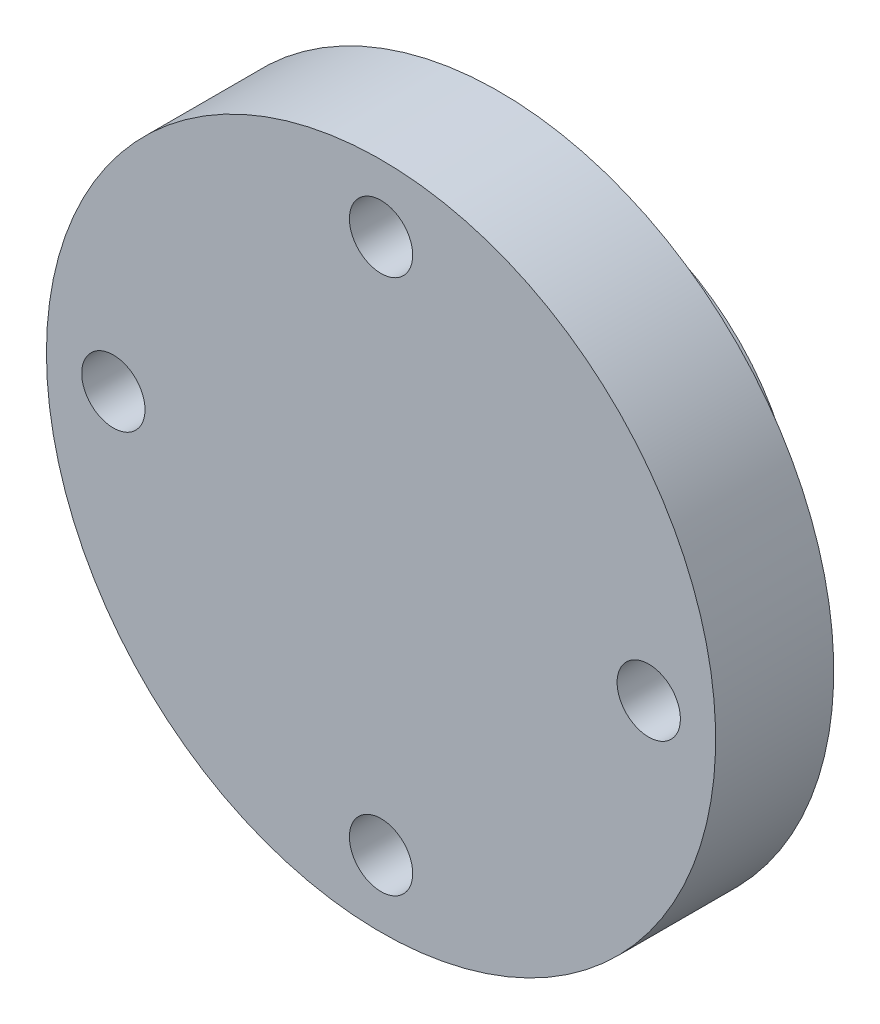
ISO-10303-21;
HEADER;
FILE_DESCRIPTION(('STEP AP214'),'2;1');
FILE_NAME('part.step','',(''),(''),'','','');
FILE_SCHEMA(('AUTOMOTIVE_DESIGN { 1 0 10303 214 1 1 1 1 }'));
ENDSEC;
DATA;
#1=APPLICATION_CONTEXT('core data for automotive mechanical design processes');
#2=APPLICATION_PROTOCOL_DEFINITION('international standard','automotive_design',2000,#1);
#3=PRODUCT_CONTEXT('',#1,'mechanical');
#4=PRODUCT('Part','Part','',(#3));
#5=PRODUCT_RELATED_PRODUCT_CATEGORY('part','',(#4));
#6=PRODUCT_DEFINITION_FORMATION('','',#4);
#7=PRODUCT_DEFINITION_CONTEXT('part definition',#1,'design');
#8=PRODUCT_DEFINITION('design','',#6,#7);
#9=PRODUCT_DEFINITION_SHAPE('','',#8);
#10=(LENGTH_UNIT() NAMED_UNIT(*) SI_UNIT(.MILLI.,.METRE.));
#11=(NAMED_UNIT(*) PLANE_ANGLE_UNIT() SI_UNIT($,.RADIAN.));
#12=(NAMED_UNIT(*) SI_UNIT($,.STERADIAN.) SOLID_ANGLE_UNIT());
#13=UNCERTAINTY_MEASURE_WITH_UNIT(LENGTH_MEASURE(1.E-05),#10,'distance_accuracy_value','');
#14=(GEOMETRIC_REPRESENTATION_CONTEXT(3) GLOBAL_UNCERTAINTY_ASSIGNED_CONTEXT((#13)) GLOBAL_UNIT_ASSIGNED_CONTEXT((#10,
#11,#12)) REPRESENTATION_CONTEXT('',''));
#15=CARTESIAN_POINT('',(0.,0.,0.));
#16=DIRECTION('',(0.,0.,1.));
#17=DIRECTION('',(1.,0.,0.));
#18=AXIS2_PLACEMENT_3D('',#15,#16,#17);
#19=CARTESIAN_POINT('',(0.,0.,-7.62));
#20=DIRECTION('',(0.,0.,1.));
#21=DIRECTION('',(1.,0.,0.));
#22=AXIS2_PLACEMENT_3D('',#19,#20,#21);
#23=CYLINDRICAL_SURFACE('',#22,16.5227);
#24=CARTESIAN_POINT('',(0.,0.,-2.4638));
#25=DIRECTION('',(0.,0.,-1.));
#26=DIRECTION('',(-1.,0.,0.));
#27=AXIS2_PLACEMENT_3D('',#24,#25,#26);
#28=CIRCLE('',#27,16.5227);
#29=CARTESIAN_POINT('',(16.5227,0.,-2.4638));
#30=VERTEX_POINT('',#29);
#31=EDGE_CURVE('E50',#30,#30,#28,.T.);
#32=CARTESIAN_POINT('',(0.,0.,0.));
#33=DIRECTION('',(0.,0.,1.));
#34=DIRECTION('',(1.,0.,0.));
#35=AXIS2_PLACEMENT_3D('',#32,#33,#34);
#36=CIRCLE('',#35,16.5227);
#37=CARTESIAN_POINT('',(16.5227,0.,0.));
#38=VERTEX_POINT('',#37);
#39=EDGE_CURVE('E10',#38,#38,#36,.F.);
#40=CARTESIAN_POINT('',(16.5227,0.,-2.4638));
#41=CARTESIAN_POINT('',(16.5227,0.,-2.43813541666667));
#42=CARTESIAN_POINT('',(16.5227,0.,-2.41247083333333));
#43=CARTESIAN_POINT('',(16.5227,0.,-2.36114166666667));
#44=CARTESIAN_POINT('',(16.5227,0.,-2.33547708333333));
#45=CARTESIAN_POINT('',(16.5227,0.,-2.28414791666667));
#46=CARTESIAN_POINT('',(16.5227,0.,-2.25848333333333));
#47=CARTESIAN_POINT('',(16.5227,0.,-2.20715416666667));
#48=CARTESIAN_POINT('',(16.5227,0.,-2.18148958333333));
#49=CARTESIAN_POINT('',(16.5227,0.,-2.13016041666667));
#50=CARTESIAN_POINT('',(16.5227,0.,-2.10449583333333));
#51=CARTESIAN_POINT('',(16.5227,0.,-2.05316666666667));
#52=CARTESIAN_POINT('',(16.5227,0.,-2.02750208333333));
#53=CARTESIAN_POINT('',(16.5227,0.,-1.97617291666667));
#54=CARTESIAN_POINT('',(16.5227,0.,-1.95050833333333));
#55=CARTESIAN_POINT('',(16.5227,0.,-1.89917916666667));
#56=CARTESIAN_POINT('',(16.5227,0.,-1.87351458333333));
#57=CARTESIAN_POINT('',(16.5227,0.,-1.82218541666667));
#58=CARTESIAN_POINT('',(16.5227,0.,-1.79652083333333));
#59=CARTESIAN_POINT('',(16.5227,0.,-1.74519166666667));
#60=CARTESIAN_POINT('',(16.5227,0.,-1.71952708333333));
#61=CARTESIAN_POINT('',(16.5227,0.,-1.66819791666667));
#62=CARTESIAN_POINT('',(16.5227,0.,-1.64253333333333));
#63=CARTESIAN_POINT('',(16.5227,0.,-1.59120416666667));
#64=CARTESIAN_POINT('',(16.5227,0.,-1.56553958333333));
#65=CARTESIAN_POINT('',(16.5227,0.,-1.51421041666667));
#66=CARTESIAN_POINT('',(16.5227,0.,-1.48854583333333));
#67=CARTESIAN_POINT('',(16.5227,0.,-1.43721666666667));
#68=CARTESIAN_POINT('',(16.5227,0.,-1.41155208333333));
#69=CARTESIAN_POINT('',(16.5227,0.,-1.36022291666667));
#70=CARTESIAN_POINT('',(16.5227,0.,-1.33455833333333));
#71=CARTESIAN_POINT('',(16.5227,0.,-1.28322916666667));
#72=CARTESIAN_POINT('',(16.5227,0.,-1.25756458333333));
#73=CARTESIAN_POINT('',(16.5227,0.,-1.20623541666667));
#74=CARTESIAN_POINT('',(16.5227,0.,-1.18057083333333));
#75=CARTESIAN_POINT('',(16.5227,0.,-1.12924166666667));
#76=CARTESIAN_POINT('',(16.5227,0.,-1.10357708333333));
#77=CARTESIAN_POINT('',(16.5227,0.,-1.05224791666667));
#78=CARTESIAN_POINT('',(16.5227,0.,-1.02658333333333));
#79=CARTESIAN_POINT('',(16.5227,0.,-0.975254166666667));
#80=CARTESIAN_POINT('',(16.5227,0.,-0.949589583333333));
#81=CARTESIAN_POINT('',(16.5227,0.,-0.898260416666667));
#82=CARTESIAN_POINT('',(16.5227,0.,-0.872595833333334));
#83=CARTESIAN_POINT('',(16.5227,0.,-0.821266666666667));
#84=CARTESIAN_POINT('',(16.5227,0.,-0.795602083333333));
#85=CARTESIAN_POINT('',(16.5227,0.,-0.744272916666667));
#86=CARTESIAN_POINT('',(16.5227,0.,-0.718608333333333));
#87=CARTESIAN_POINT('',(16.5227,0.,-0.667279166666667));
#88=CARTESIAN_POINT('',(16.5227,0.,-0.641614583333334));
#89=CARTESIAN_POINT('',(16.5227,0.,-0.590285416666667));
#90=CARTESIAN_POINT('',(16.5227,0.,-0.564620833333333));
#91=CARTESIAN_POINT('',(16.5227,0.,-0.513291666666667));
#92=CARTESIAN_POINT('',(16.5227,0.,-0.487627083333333));
#93=CARTESIAN_POINT('',(16.5227,0.,-0.436297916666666));
#94=CARTESIAN_POINT('',(16.5227,0.,-0.410633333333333));
#95=CARTESIAN_POINT('',(16.5227,0.,-0.359304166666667));
#96=CARTESIAN_POINT('',(16.5227,0.,-0.333639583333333));
#97=CARTESIAN_POINT('',(16.5227,0.,-0.282310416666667));
#98=CARTESIAN_POINT('',(16.5227,0.,-0.256645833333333));
#99=CARTESIAN_POINT('',(16.5227,0.,-0.205316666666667));
#100=CARTESIAN_POINT('',(16.5227,0.,-0.179652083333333));
#101=CARTESIAN_POINT('',(16.5227,0.,-0.128322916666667));
#102=CARTESIAN_POINT('',(16.5227,0.,-0.102658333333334));
#103=CARTESIAN_POINT('',(16.5227,0.,-0.051329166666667));
#104=CARTESIAN_POINT('',(16.5227,0.,-0.0256645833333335));
#105=CARTESIAN_POINT('',(16.5227,0.,0.));
#106=B_SPLINE_CURVE_WITH_KNOTS('',3,(#40,#41,#42,#43,#44,#45,#46,#47,#48,#49,#50,#51,#52,#53,
#54,#55,#56,#57,#58,#59,#60,#61,#62,#63,#64,#65,#66,#67,#68,#69,#70,#71,#72,#73,#74,#75,#76,#77,
#78,#79,#80,#81,#82,#83,#84,#85,#86,#87,#88,#89,#90,#91,#92,#93,#94,#95,#96,#97,#98,#99,#100,
#101,#102,#103,#104,#105),.UNSPECIFIED.,.F.,.F.,(4,2,2,2,2,2,2,2,2,2,2,2,2,2,2,2,2,2,2,2,2,2,2,
2,2,2,2,2,2,2,2,2,4),(0.,0.0769937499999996,0.1539875,0.23098125,0.307975,0.38496875,0.4619625,
0.53895625,0.615950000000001,0.69294375,0.7699375,0.84693125,0.923925,1.00091875,1.0779125,
1.15490625,1.2319,1.30889375,1.3858875,1.46288125,1.539875,1.61686875,1.6938625,1.77085625,
1.84785,1.92484375,2.0018375,2.07883125,2.155825,2.23281875,2.3098125,2.38680625,2.4638),.UNSPECIFIED.);
#107=EDGE_CURVE('BSEAM30',#30,#38,#106,.T.);
#108=ORIENTED_EDGE('',*,*,#31,.F.);
#109=ORIENTED_EDGE('',*,*,#39,.T.);
#110=ORIENTED_EDGE('',*,*,#107,.T.);
#111=ORIENTED_EDGE('',*,*,#107,.F.);
#112=EDGE_LOOP('',(#108,#110,#109,#111));
#113=FACE_BOUND('',#112,.T.);
#114=ADVANCED_FACE('F30',(#113),#23,.T.);
#115=CARTESIAN_POINT('',(0.,0.,0.));
#116=DIRECTION('',(0.,0.,1.));
#117=DIRECTION('',(1.,0.,0.));
#118=AXIS2_PLACEMENT_3D('',#115,#116,#117);
#119=PLANE('',#118);
#120=CARTESIAN_POINT('',(0.,-21.59,0.));
#121=DIRECTION('',(0.,0.,1.));
#122=DIRECTION('',(1.,0.,0.));
#123=AXIS2_PLACEMENT_3D('',#120,#121,#122);
#124=CIRCLE('',#123,2.55269999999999);
#125=CARTESIAN_POINT('',(2.55269999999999,-21.59,0.));
#126=VERTEX_POINT('',#125);
#127=EDGE_CURVE('E80',#126,#126,#124,.T.);
#128=ORIENTED_EDGE('',*,*,#127,.T.);
#129=EDGE_LOOP('',(#128));
#130=FACE_BOUND('',#129,.T.);
#131=CARTESIAN_POINT('',(21.59,0.,0.));
#132=DIRECTION('',(0.,0.,1.));
#133=DIRECTION('',(1.,0.,0.));
#134=AXIS2_PLACEMENT_3D('',#131,#132,#133);
#135=CIRCLE('',#134,2.55269999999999);
#136=CARTESIAN_POINT('',(24.1427,0.,0.));
#137=VERTEX_POINT('',#136);
#138=EDGE_CURVE('E74',#137,#137,#135,.T.);
#139=ORIENTED_EDGE('',*,*,#138,.T.);
#140=EDGE_LOOP('',(#139));
#141=FACE_BOUND('',#140,.T.);
#142=CARTESIAN_POINT('',(0.,21.59,0.));
#143=DIRECTION('',(0.,0.,1.));
#144=DIRECTION('',(1.,0.,0.));
#145=AXIS2_PLACEMENT_3D('',#142,#143,#144);
#146=CIRCLE('',#145,2.55269999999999);
#147=CARTESIAN_POINT('',(2.55269999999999,21.59,0.));
#148=VERTEX_POINT('',#147);
#149=EDGE_CURVE('E68',#148,#148,#146,.T.);
#150=ORIENTED_EDGE('',*,*,#149,.T.);
#151=EDGE_LOOP('',(#150));
#152=FACE_BOUND('',#151,.T.);
#153=CARTESIAN_POINT('',(-21.59,0.,0.));
#154=DIRECTION('',(0.,0.,1.));
#155=DIRECTION('',(1.,0.,0.));
#156=AXIS2_PLACEMENT_3D('',#153,#154,#155);
#157=CIRCLE('',#156,2.55269999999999);
#158=CARTESIAN_POINT('',(-19.0373,0.,0.));
#159=VERTEX_POINT('',#158);
#160=EDGE_CURVE('E62',#159,#159,#157,.T.);
#161=ORIENTED_EDGE('',*,*,#160,.T.);
#162=EDGE_LOOP('',(#161));
#163=FACE_BOUND('',#162,.T.);
#164=CARTESIAN_POINT('',(0.,0.,0.));
#165=DIRECTION('',(0.,0.,1.));
#166=DIRECTION('',(1.,0.,0.));
#167=AXIS2_PLACEMENT_3D('',#164,#165,#166);
#168=CIRCLE('',#167,26.9875);
#169=CARTESIAN_POINT('',(-26.9875,0.,0.));
#170=VERTEX_POINT('',#169);
#171=EDGE_CURVE('E41',#170,#170,#168,.T.);
#172=ORIENTED_EDGE('',*,*,#171,.F.);
#173=EDGE_LOOP('',(#172));
#174=FACE_BOUND('',#173,.T.);
#175=ORIENTED_EDGE('',*,*,#39,.F.);
#176=EDGE_LOOP('',(#175));
#177=FACE_BOUND('',#176,.T.);
#178=ADVANCED_FACE('F119',(#130,#141,#152,#163,#174,#177),#119,.F.);
#179=CARTESIAN_POINT('',(0.,0.,9.525));
#180=DIRECTION('',(0.,0.,-1.));
#181=DIRECTION('',(-1.,0.,0.));
#182=AXIS2_PLACEMENT_3D('',#179,#180,#181);
#183=CYLINDRICAL_SURFACE('',#182,26.9875);
#184=CARTESIAN_POINT('',(0.,0.,9.525));
#185=DIRECTION('',(0.,0.,1.));
#186=DIRECTION('',(1.,0.,0.));
#187=AXIS2_PLACEMENT_3D('',#184,#185,#186);
#188=CIRCLE('',#187,26.9875);
#189=CARTESIAN_POINT('',(-26.9875,0.,9.525));
#190=VERTEX_POINT('',#189);
#191=EDGE_CURVE('E37',#190,#190,#188,.T.);
#192=CARTESIAN_POINT('',(-26.9875,0.,9.525));
#193=CARTESIAN_POINT('',(-26.9875,0.,9.42578125));
#194=CARTESIAN_POINT('',(-26.9875,0.,9.3265625));
#195=CARTESIAN_POINT('',(-26.9875,0.,9.128125));
#196=CARTESIAN_POINT('',(-26.9875,0.,9.02890625));
#197=CARTESIAN_POINT('',(-26.9875,0.,8.83046875));
#198=CARTESIAN_POINT('',(-26.9875,0.,8.73125));
#199=CARTESIAN_POINT('',(-26.9875,0.,8.5328125));
#200=CARTESIAN_POINT('',(-26.9875,0.,8.43359375));
#201=CARTESIAN_POINT('',(-26.9875,0.,8.23515625));
#202=CARTESIAN_POINT('',(-26.9875,0.,8.1359375));
#203=CARTESIAN_POINT('',(-26.9875,0.,7.9375));
#204=CARTESIAN_POINT('',(-26.9875,0.,7.83828125));
#205=CARTESIAN_POINT('',(-26.9875,0.,7.63984375));
#206=CARTESIAN_POINT('',(-26.9875,0.,7.540625));
#207=CARTESIAN_POINT('',(-26.9875,0.,7.3421875));
#208=CARTESIAN_POINT('',(-26.9875,0.,7.24296875));
#209=CARTESIAN_POINT('',(-26.9875,0.,7.04453125));
#210=CARTESIAN_POINT('',(-26.9875,0.,6.9453125));
#211=CARTESIAN_POINT('',(-26.9875,0.,6.746875));
#212=CARTESIAN_POINT('',(-26.9875,0.,6.64765625));
#213=CARTESIAN_POINT('',(-26.9875,0.,6.44921875));
#214=CARTESIAN_POINT('',(-26.9875,0.,6.35));
#215=CARTESIAN_POINT('',(-26.9875,0.,6.1515625));
#216=CARTESIAN_POINT('',(-26.9875,0.,6.05234375));
#217=CARTESIAN_POINT('',(-26.9875,0.,5.85390625));
#218=CARTESIAN_POINT('',(-26.9875,0.,5.7546875));
#219=CARTESIAN_POINT('',(-26.9875,0.,5.55625));
#220=CARTESIAN_POINT('',(-26.9875,0.,5.45703125));
#221=CARTESIAN_POINT('',(-26.9875,0.,5.25859375));
#222=CARTESIAN_POINT('',(-26.9875,0.,5.159375));
#223=CARTESIAN_POINT('',(-26.9875,0.,4.9609375));
#224=CARTESIAN_POINT('',(-26.9875,0.,4.86171875));
#225=CARTESIAN_POINT('',(-26.9875,0.,4.66328125));
#226=CARTESIAN_POINT('',(-26.9875,0.,4.5640625));
#227=CARTESIAN_POINT('',(-26.9875,0.,4.365625));
#228=CARTESIAN_POINT('',(-26.9875,0.,4.26640625));
#229=CARTESIAN_POINT('',(-26.9875,0.,4.06796875));
#230=CARTESIAN_POINT('',(-26.9875,0.,3.96875));
#231=CARTESIAN_POINT('',(-26.9875,0.,3.7703125));
#232=CARTESIAN_POINT('',(-26.9875,0.,3.67109375));
#233=CARTESIAN_POINT('',(-26.9875,0.,3.47265625));
#234=CARTESIAN_POINT('',(-26.9875,0.,3.3734375));
#235=CARTESIAN_POINT('',(-26.9875,0.,3.175));
#236=CARTESIAN_POINT('',(-26.9875,0.,3.07578125));
#237=CARTESIAN_POINT('',(-26.9875,0.,2.87734375));
#238=CARTESIAN_POINT('',(-26.9875,0.,2.778125));
#239=CARTESIAN_POINT('',(-26.9875,0.,2.5796875));
#240=CARTESIAN_POINT('',(-26.9875,0.,2.48046875));
#241=CARTESIAN_POINT('',(-26.9875,0.,2.28203125));
#242=CARTESIAN_POINT('',(-26.9875,0.,2.1828125));
#243=CARTESIAN_POINT('',(-26.9875,0.,1.984375));
#244=CARTESIAN_POINT('',(-26.9875,0.,1.88515625));
#245=CARTESIAN_POINT('',(-26.9875,0.,1.68671875));
#246=CARTESIAN_POINT('',(-26.9875,0.,1.5875));
#247=CARTESIAN_POINT('',(-26.9875,0.,1.3890625));
#248=CARTESIAN_POINT('',(-26.9875,0.,1.28984375));
#249=CARTESIAN_POINT('',(-26.9875,0.,1.09140625));
#250=CARTESIAN_POINT('',(-26.9875,0.,0.992187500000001));
#251=CARTESIAN_POINT('',(-26.9875,0.,0.793750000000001));
#252=CARTESIAN_POINT('',(-26.9875,0.,0.69453125));
#253=CARTESIAN_POINT('',(-26.9875,0.,0.49609375));
#254=CARTESIAN_POINT('',(-26.9875,0.,0.396875));
#255=CARTESIAN_POINT('',(-26.9875,0.,0.1984375));
#256=CARTESIAN_POINT('',(-26.9875,0.,0.0992187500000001));
#257=CARTESIAN_POINT('',(-26.9875,0.,0.));
#258=B_SPLINE_CURVE_WITH_KNOTS('',3,(#192,#193,#194,#195,#196,#197,#198,#199,#200,#201,#202,
#203,#204,#205,#206,#207,#208,#209,#210,#211,#212,#213,#214,#215,#216,#217,#218,#219,#220,#221,
#222,#223,#224,#225,#226,#227,#228,#229,#230,#231,#232,#233,#234,#235,#236,#237,#238,#239,#240,
#241,#242,#243,#244,#245,#246,#247,#248,#249,#250,#251,#252,#253,#254,#255,#256,#257),
.UNSPECIFIED.,.F.,.F.,(4,2,2,2,2,2,2,2,2,2,2,2,2,2,2,2,2,2,2,2,2,2,2,2,2,2,2,2,2,2,2,2,4),(0.,
0.297656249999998,0.595312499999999,0.892968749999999,1.190625,1.48828125,1.7859375,2.08359375,
2.38125,2.67890625,2.9765625,3.27421875,3.571875,3.86953125,4.1671875,4.46484375,4.7625,
5.06015625,5.3578125,5.65546875,5.953125,6.25078125,6.5484375,6.84609375,7.14375,7.44140625,
7.7390625,8.03671875,8.334375,8.63203125,8.9296875,9.22734375,9.525),.UNSPECIFIED.);
#259=EDGE_CURVE('BSEAM32',#190,#170,#258,.T.);
#260=ORIENTED_EDGE('',*,*,#191,.F.);
#261=ORIENTED_EDGE('',*,*,#171,.T.);
#262=ORIENTED_EDGE('',*,*,#259,.T.);
#263=ORIENTED_EDGE('',*,*,#259,.F.);
#264=EDGE_LOOP('',(#260,#262,#261,#263));
#265=FACE_BOUND('',#264,.T.);
#266=ADVANCED_FACE('F32',(#265),#183,.T.);
#267=CARTESIAN_POINT('',(0.,0.,9.525));
#268=DIRECTION('',(0.,0.,1.));
#269=DIRECTION('',(1.,0.,0.));
#270=AXIS2_PLACEMENT_3D('',#267,#268,#269);
#271=PLANE('',#270);
#272=CARTESIAN_POINT('',(0.,-21.59,9.525));
#273=DIRECTION('',(0.,0.,1.));
#274=DIRECTION('',(1.,0.,0.));
#275=AXIS2_PLACEMENT_3D('',#272,#273,#274);
#276=CIRCLE('',#275,2.55269999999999);
#277=CARTESIAN_POINT('',(2.55269999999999,-21.59,9.525));
#278=VERTEX_POINT('',#277);
#279=EDGE_CURVE('E83',#278,#278,#276,.T.);
#280=ORIENTED_EDGE('',*,*,#279,.F.);
#281=EDGE_LOOP('',(#280));
#282=FACE_BOUND('',#281,.T.);
#283=CARTESIAN_POINT('',(21.59,0.,9.525));
#284=DIRECTION('',(0.,0.,1.));
#285=DIRECTION('',(1.,0.,0.));
#286=AXIS2_PLACEMENT_3D('',#283,#284,#285);
#287=CIRCLE('',#286,2.55269999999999);
#288=CARTESIAN_POINT('',(24.1427,0.,9.525));
#289=VERTEX_POINT('',#288);
#290=EDGE_CURVE('E77',#289,#289,#287,.T.);
#291=ORIENTED_EDGE('',*,*,#290,.F.);
#292=EDGE_LOOP('',(#291));
#293=FACE_BOUND('',#292,.T.);
#294=CARTESIAN_POINT('',(0.,21.59,9.525));
#295=DIRECTION('',(0.,0.,1.));
#296=DIRECTION('',(1.,0.,0.));
#297=AXIS2_PLACEMENT_3D('',#294,#295,#296);
#298=CIRCLE('',#297,2.55269999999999);
#299=CARTESIAN_POINT('',(2.55269999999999,21.59,9.525));
#300=VERTEX_POINT('',#299);
#301=EDGE_CURVE('E71',#300,#300,#298,.T.);
#302=ORIENTED_EDGE('',*,*,#301,.F.);
#303=EDGE_LOOP('',(#302));
#304=FACE_BOUND('',#303,.T.);
#305=CARTESIAN_POINT('',(-21.59,0.,9.525));
#306=DIRECTION('',(0.,0.,1.));
#307=DIRECTION('',(1.,0.,0.));
#308=AXIS2_PLACEMENT_3D('',#305,#306,#307);
#309=CIRCLE('',#308,2.55269999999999);
#310=CARTESIAN_POINT('',(-19.0373,0.,9.525));
#311=VERTEX_POINT('',#310);
#312=EDGE_CURVE('E65',#311,#311,#309,.T.);
#313=ORIENTED_EDGE('',*,*,#312,.F.);
#314=EDGE_LOOP('',(#313));
#315=FACE_BOUND('',#314,.T.);
#316=ORIENTED_EDGE('',*,*,#191,.T.);
#317=EDGE_LOOP('',(#316));
#318=FACE_BOUND('',#317,.T.);
#319=ADVANCED_FACE('F89',(#282,#293,#304,#315,#318),#271,.T.);
#320=CARTESIAN_POINT('',(-16.5227,0.,-2.4638));
#321=DIRECTION('',(0.,0.,1.));
#322=DIRECTION('',(1.,0.,0.));
#323=AXIS2_PLACEMENT_3D('',#320,#321,#322);
#324=PLANE('',#323);
#325=CARTESIAN_POINT('',(0.,0.,-2.4638));
#326=DIRECTION('',(0.,0.,-1.));
#327=DIRECTION('',(-1.,0.,0.));
#328=AXIS2_PLACEMENT_3D('',#325,#326,#327);
#329=CIRCLE('',#328,15.1765);
#330=CARTESIAN_POINT('',(-15.1765,0.,-2.4638));
#331=VERTEX_POINT('',#330);
#332=EDGE_CURVE('E53',#331,#331,#329,.T.);
#333=ORIENTED_EDGE('',*,*,#332,.F.);
#334=EDGE_LOOP('',(#333));
#335=FACE_BOUND('',#334,.T.);
#336=ORIENTED_EDGE('',*,*,#31,.T.);
#337=EDGE_LOOP('',(#336));
#338=FACE_BOUND('',#337,.T.);
#339=ADVANCED_FACE('F92',(#335,#338),#324,.F.);
#340=CARTESIAN_POINT('',(0.,0.,-8.47725));
#341=DIRECTION('',(0.,0.,-1.));
#342=DIRECTION('',(-1.,0.,0.));
#343=AXIS2_PLACEMENT_3D('',#340,#341,#342);
#344=CYLINDRICAL_SURFACE('',#343,15.1765);
#345=CARTESIAN_POINT('',(0.,0.,-5.08));
#346=DIRECTION('',(0.,0.,-1.));
#347=DIRECTION('',(-1.,0.,0.));
#348=AXIS2_PLACEMENT_3D('',#345,#346,#347);
#349=CIRCLE('',#348,15.1765);
#350=CARTESIAN_POINT('',(-15.1765,0.,-5.08));
#351=VERTEX_POINT('',#350);
#352=EDGE_CURVE('E56',#351,#351,#349,.T.);
#353=ORIENTED_EDGE('',*,*,#352,.F.);
#354=EDGE_LOOP('',(#353));
#355=FACE_BOUND('',#354,.T.);
#356=ORIENTED_EDGE('',*,*,#332,.T.);
#357=EDGE_LOOP('',(#356));
#358=FACE_BOUND('',#357,.T.);
#359=ADVANCED_FACE('F133',(#355,#358),#344,.T.);
#360=CARTESIAN_POINT('',(-15.1765,0.,-5.08));
#361=DIRECTION('',(0.,0.,-1.));
#362=DIRECTION('',(-1.,0.,0.));
#363=AXIS2_PLACEMENT_3D('',#360,#361,#362);
#364=PLANE('',#363);
#365=CARTESIAN_POINT('',(0.,0.,-5.08));
#366=DIRECTION('',(0.,0.,-1.));
#367=DIRECTION('',(-1.,0.,0.));
#368=AXIS2_PLACEMENT_3D('',#365,#366,#367);
#369=CIRCLE('',#368,16.5227);
#370=CARTESIAN_POINT('',(16.5227,0.,-5.08));
#371=VERTEX_POINT('',#370);
#372=EDGE_CURVE('E59',#371,#371,#369,.T.);
#373=ORIENTED_EDGE('',*,*,#372,.F.);
#374=EDGE_LOOP('',(#373));
#375=FACE_BOUND('',#374,.T.);
#376=ORIENTED_EDGE('',*,*,#352,.T.);
#377=EDGE_LOOP('',(#376));
#378=FACE_BOUND('',#377,.T.);
#379=ADVANCED_FACE('F129',(#375,#378),#364,.F.);
#380=CARTESIAN_POINT('',(0.,0.,-7.62));
#381=DIRECTION('',(0.,0.,-1.));
#382=DIRECTION('',(-1.,0.,0.));
#383=AXIS2_PLACEMENT_3D('',#380,#381,#382);
#384=PLANE('',#383);
#385=CARTESIAN_POINT('',(0.,0.,-7.62));
#386=DIRECTION('',(0.,0.,-1.));
#387=DIRECTION('',(-1.,0.,0.));
#388=AXIS2_PLACEMENT_3D('',#385,#386,#387);
#389=CIRCLE('',#388,16.5227);
#390=CARTESIAN_POINT('',(16.5227,0.,-7.62));
#391=VERTEX_POINT('',#390);
#392=EDGE_CURVE('E46',#391,#391,#389,.T.);
#393=ORIENTED_EDGE('',*,*,#392,.T.);
#394=EDGE_LOOP('',(#393));
#395=FACE_BOUND('',#394,.T.);
#396=ADVANCED_FACE('F113',(#395),#384,.T.);
#397=CARTESIAN_POINT('',(16.5227,0.,-5.08));
#398=CARTESIAN_POINT('',(16.5227,0.,-5.10645833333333));
#399=CARTESIAN_POINT('',(16.5227,0.,-5.13291666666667));
#400=CARTESIAN_POINT('',(16.5227,0.,-5.18583333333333));
#401=CARTESIAN_POINT('',(16.5227,0.,-5.21229166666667));
#402=CARTESIAN_POINT('',(16.5227,0.,-5.26520833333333));
#403=CARTESIAN_POINT('',(16.5227,0.,-5.29166666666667));
#404=CARTESIAN_POINT('',(16.5227,0.,-5.34458333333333));
#405=CARTESIAN_POINT('',(16.5227,0.,-5.37104166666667));
#406=CARTESIAN_POINT('',(16.5227,0.,-5.42395833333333));
#407=CARTESIAN_POINT('',(16.5227,0.,-5.45041666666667));
#408=CARTESIAN_POINT('',(16.5227,0.,-5.50333333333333));
#409=CARTESIAN_POINT('',(16.5227,0.,-5.52979166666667));
#410=CARTESIAN_POINT('',(16.5227,0.,-5.58270833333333));
#411=CARTESIAN_POINT('',(16.5227,0.,-5.60916666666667));
#412=CARTESIAN_POINT('',(16.5227,0.,-5.66208333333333));
#413=CARTESIAN_POINT('',(16.5227,0.,-5.68854166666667));
#414=CARTESIAN_POINT('',(16.5227,0.,-5.74145833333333));
#415=CARTESIAN_POINT('',(16.5227,0.,-5.76791666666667));
#416=CARTESIAN_POINT('',(16.5227,0.,-5.82083333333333));
#417=CARTESIAN_POINT('',(16.5227,0.,-5.84729166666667));
#418=CARTESIAN_POINT('',(16.5227,0.,-5.90020833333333));
#419=CARTESIAN_POINT('',(16.5227,0.,-5.92666666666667));
#420=CARTESIAN_POINT('',(16.5227,0.,-5.97958333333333));
#421=CARTESIAN_POINT('',(16.5227,0.,-6.00604166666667));
#422=CARTESIAN_POINT('',(16.5227,0.,-6.05895833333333));
#423=CARTESIAN_POINT('',(16.5227,0.,-6.08541666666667));
#424=CARTESIAN_POINT('',(16.5227,0.,-6.13833333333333));
#425=CARTESIAN_POINT('',(16.5227,0.,-6.16479166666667));
#426=CARTESIAN_POINT('',(16.5227,0.,-6.21770833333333));
#427=CARTESIAN_POINT('',(16.5227,0.,-6.24416666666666));
#428=CARTESIAN_POINT('',(16.5227,0.,-6.29708333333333));
#429=CARTESIAN_POINT('',(16.5227,0.,-6.32354166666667));
#430=CARTESIAN_POINT('',(16.5227,0.,-6.37645833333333));
#431=CARTESIAN_POINT('',(16.5227,0.,-6.40291666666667));
#432=CARTESIAN_POINT('',(16.5227,0.,-6.45583333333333));
#433=CARTESIAN_POINT('',(16.5227,0.,-6.48229166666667));
#434=CARTESIAN_POINT('',(16.5227,0.,-6.53520833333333));
#435=CARTESIAN_POINT('',(16.5227,0.,-6.56166666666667));
#436=CARTESIAN_POINT('',(16.5227,0.,-6.61458333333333));
#437=CARTESIAN_POINT('',(16.5227,0.,-6.64104166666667));
#438=CARTESIAN_POINT('',(16.5227,0.,-6.69395833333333));
#439=CARTESIAN_POINT('',(16.5227,0.,-6.72041666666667));
#440=CARTESIAN_POINT('',(16.5227,0.,-6.77333333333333));
#441=CARTESIAN_POINT('',(16.5227,0.,-6.79979166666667));
#442=CARTESIAN_POINT('',(16.5227,0.,-6.85270833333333));
#443=CARTESIAN_POINT('',(16.5227,0.,-6.87916666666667));
#444=CARTESIAN_POINT('',(16.5227,0.,-6.93208333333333));
#445=CARTESIAN_POINT('',(16.5227,0.,-6.95854166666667));
#446=CARTESIAN_POINT('',(16.5227,0.,-7.01145833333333));
#447=CARTESIAN_POINT('',(16.5227,0.,-7.03791666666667));
#448=CARTESIAN_POINT('',(16.5227,0.,-7.09083333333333));
#449=CARTESIAN_POINT('',(16.5227,0.,-7.11729166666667));
#450=CARTESIAN_POINT('',(16.5227,0.,-7.17020833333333));
#451=CARTESIAN_POINT('',(16.5227,0.,-7.19666666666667));
#452=CARTESIAN_POINT('',(16.5227,0.,-7.24958333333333));
#453=CARTESIAN_POINT('',(16.5227,0.,-7.27604166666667));
#454=CARTESIAN_POINT('',(16.5227,0.,-7.32895833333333));
#455=CARTESIAN_POINT('',(16.5227,0.,-7.35541666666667));
#456=CARTESIAN_POINT('',(16.5227,0.,-7.40833333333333));
#457=CARTESIAN_POINT('',(16.5227,0.,-7.43479166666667));
#458=CARTESIAN_POINT('',(16.5227,0.,-7.48770833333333));
#459=CARTESIAN_POINT('',(16.5227,0.,-7.51416666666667));
#460=CARTESIAN_POINT('',(16.5227,0.,-7.56708333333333));
#461=CARTESIAN_POINT('',(16.5227,0.,-7.59354166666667));
#462=CARTESIAN_POINT('',(16.5227,0.,-7.62));
#463=B_SPLINE_CURVE_WITH_KNOTS('',3,(#397,#398,#399,#400,#401,#402,#403,#404,#405,#406,#407,
#408,#409,#410,#411,#412,#413,#414,#415,#416,#417,#418,#419,#420,#421,#422,#423,#424,#425,#426,
#427,#428,#429,#430,#431,#432,#433,#434,#435,#436,#437,#438,#439,#440,#441,#442,#443,#444,#445,
#446,#447,#448,#449,#450,#451,#452,#453,#454,#455,#456,#457,#458,#459,#460,#461,#462),
.UNSPECIFIED.,.F.,.F.,(4,2,2,2,2,2,2,2,2,2,2,2,2,2,2,2,2,2,2,2,2,2,2,2,2,2,2,2,2,2,2,2,4),(0.,
0.0793749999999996,0.158749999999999,0.238125,0.3175,0.396875,0.476249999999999,0.555625,
0.634999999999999,0.714375,0.793749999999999,0.873125,0.952499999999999,1.031875,1.11125,
1.190625,1.27,1.349375,1.42875,1.508125,1.5875,1.666875,1.74625,1.825625,1.905,1.984375,2.06375,
2.143125,2.2225,2.301875,2.38125,2.460625,2.54),.UNSPECIFIED.);
#464=EDGE_CURVE('BSEAM103',#371,#391,#463,.T.);
#465=ORIENTED_EDGE('',*,*,#372,.T.);
#466=ORIENTED_EDGE('',*,*,#392,.F.);
#467=ORIENTED_EDGE('',*,*,#464,.T.);
#468=ORIENTED_EDGE('',*,*,#464,.F.);
#469=EDGE_LOOP('',(#465,#467,#466,#468));
#470=FACE_BOUND('',#469,.T.);
#471=ADVANCED_FACE('F103',(#470),#23,.T.);
#472=CARTESIAN_POINT('',(-21.59,0.,9.525));
#473=DIRECTION('',(0.,0.,1.));
#474=DIRECTION('',(1.,0.,0.));
#475=AXIS2_PLACEMENT_3D('',#472,#473,#474);
#476=CYLINDRICAL_SURFACE('',#475,2.55269999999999);
#477=ORIENTED_EDGE('',*,*,#160,.F.);
#478=EDGE_LOOP('',(#477));
#479=FACE_BOUND('',#478,.T.);
#480=ORIENTED_EDGE('',*,*,#312,.T.);
#481=EDGE_LOOP('',(#480));
#482=FACE_BOUND('',#481,.T.);
#483=ADVANCED_FACE('F100',(#479,#482),#476,.F.);
#484=CARTESIAN_POINT('',(0.,21.59,9.525));
#485=DIRECTION('',(0.,0.,1.));
#486=DIRECTION('',(1.,0.,0.));
#487=AXIS2_PLACEMENT_3D('',#484,#485,#486);
#488=CYLINDRICAL_SURFACE('',#487,2.55269999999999);
#489=ORIENTED_EDGE('',*,*,#149,.F.);
#490=EDGE_LOOP('',(#489));
#491=FACE_BOUND('',#490,.T.);
#492=ORIENTED_EDGE('',*,*,#301,.T.);
#493=EDGE_LOOP('',(#492));
#494=FACE_BOUND('',#493,.T.);
#495=ADVANCED_FACE('F102',(#491,#494),#488,.F.);
#496=CARTESIAN_POINT('',(21.59,0.,9.525));
#497=DIRECTION('',(0.,0.,1.));
#498=DIRECTION('',(1.,0.,0.));
#499=AXIS2_PLACEMENT_3D('',#496,#497,#498);
#500=CYLINDRICAL_SURFACE('',#499,2.55269999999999);
#501=ORIENTED_EDGE('',*,*,#138,.F.);
#502=EDGE_LOOP('',(#501));
#503=FACE_BOUND('',#502,.T.);
#504=ORIENTED_EDGE('',*,*,#290,.T.);
#505=EDGE_LOOP('',(#504));
#506=FACE_BOUND('',#505,.T.);
#507=ADVANCED_FACE('F110',(#503,#506),#500,.F.);
#508=CARTESIAN_POINT('',(0.,-21.59,9.525));
#509=DIRECTION('',(0.,0.,1.));
#510=DIRECTION('',(1.,0.,0.));
#511=AXIS2_PLACEMENT_3D('',#508,#509,#510);
#512=CYLINDRICAL_SURFACE('',#511,2.55269999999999);
#513=ORIENTED_EDGE('',*,*,#127,.F.);
#514=EDGE_LOOP('',(#513));
#515=FACE_BOUND('',#514,.T.);
#516=ORIENTED_EDGE('',*,*,#279,.T.);
#517=EDGE_LOOP('',(#516));
#518=FACE_BOUND('',#517,.T.);
#519=ADVANCED_FACE('F87',(#515,#518),#512,.F.);
#520=CLOSED_SHELL('',(#114,#178,#266,#319,#339,#359,#379,#396,#471,#483,#495,#507,#519));
#521=MANIFOLD_SOLID_BREP('B2',#520);
#522=ADVANCED_BREP_SHAPE_REPRESENTATION('',(#18,#521),#14);
#523=SHAPE_DEFINITION_REPRESENTATION(#9,#522);
ENDSEC;
END-ISO-10303-21;
